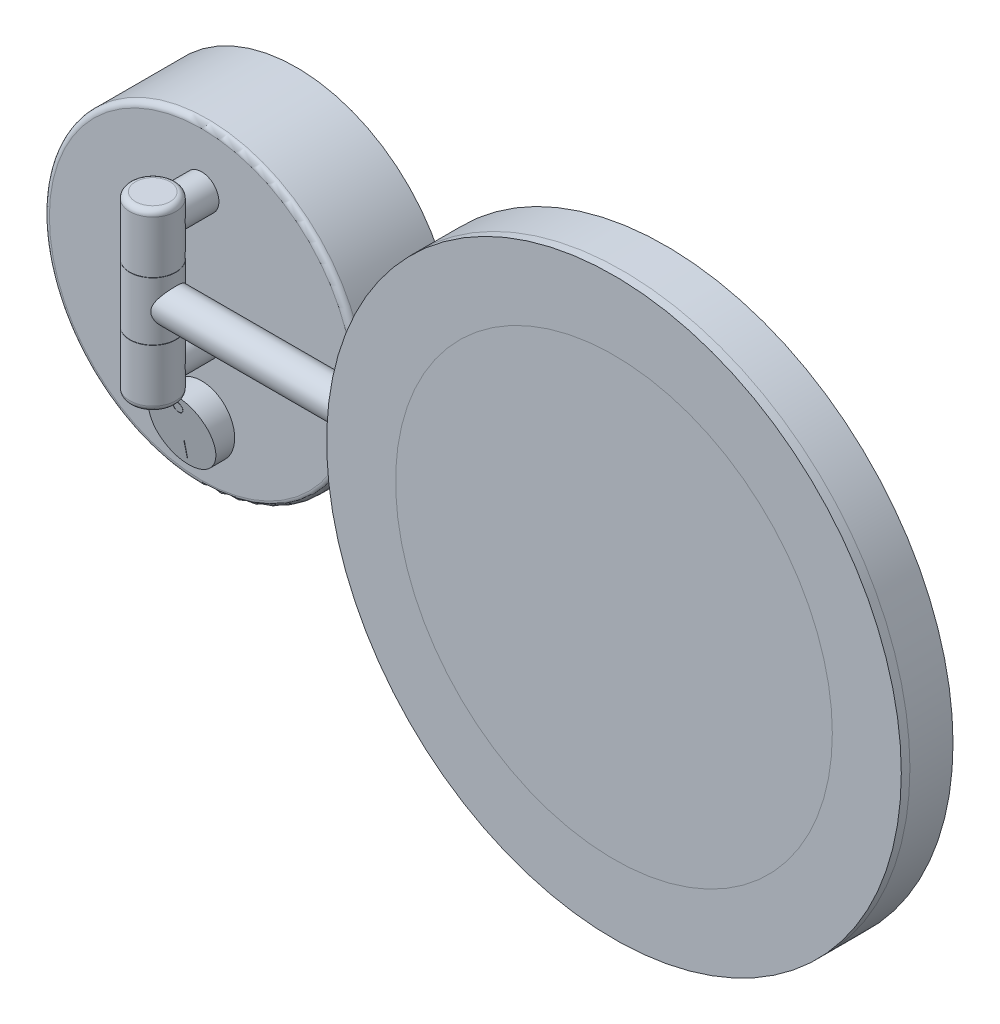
from build123d import *
from build123d.topology import SkipClean

# Parameters (mm, degrees)
CROQUIS1_R                 = 55
SALIENTE_EXTRUIR1_DEPTH    = 33
CROQUIS2_R                 = 6
SALIENTE_EXTRUIR2_DEPTH    = 9
BARRER1_PROFILE_R          = 8
SALIENTE_EXTRUIR3_REACH    = 90.397
CROQUIS17_R                = 6
SALIENTE_EXTRUIR4_DEPTH    = 9
CORTAR_EXTRUIR1_DEPTH      = 98.025769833
CORTAR_EXTRUIR1_DEPTH_BACK = 98.025769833
CROQUIS23_W                = 0.2
CROQUIS23_H                = 6
CORTAR_EXTRUIR2_DEPTH      = 0.1
CROQUIS24_R                = 1.785264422
CROQUIS24_R_2              = 1.685264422
CORTAR_EXTRUIR3_DEPTH      = 0.1
CROQUIS25_R                = 6
SALIENTE_EXTRUIR5_DEPTH    = 200
BARRER2_PROFILE_R          = 8
BARRER3_PROFILE_R          = 8
CROQUIS65_R                = 6.5
SALIENTE_EXTRUIR6_DEPTH    = 16
CROQUIS66_R                = 100
SALIENTE_EXTRUIR7_DEPTH    = 15
CROQUIS67_R                = 100
CROQUIS67_R_2              = 76
SALIENTE_EXTRUIR9_DEPTH    = 3
CROQUIS68_R                = 76
SALIENTE_EXTRUIR10_DEPTH   = 3
REDONDEO1_R                = 2
REDONDEO2_R                = 2
CROQUIS69_R                = 8.543506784
CROQUIS69_R_2              = 7.600875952
CORTAR_EXTRUIR4_DEPTH      = 0.1
CROQUIS70_R                = 8.543506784
CROQUIS70_R_2              = 7.600875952
CROQUIS70_R_3              = 9.674431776
CROQUIS70_R_4              = 7.055159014
CORTAR_EXTRUIR5_DEPTH      = 0.1
CROQUIS71_R                = 9.293521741
CROQUIS71_R_2              = 7.297415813
CORTAR_EXTRUIR6_DEPTH      = 0.1
CROQUIS72_R                = 9.21017824
CROQUIS72_R_2              = 7.558824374
CORTAR_EXTRUIR7_DEPTH      = 0.1
CROQUIS73_R                = 9.123708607
CROQUIS73_R_2              = 7.319281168
CORTAR_EXTRUIR8_DEPTH      = 0.1
CROQUIS74_R                = 9.729453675
CROQUIS74_R_2              = 7.072832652
CORTAR_EXTRUIR9_DEPTH      = 0.1
CROQUIS75_R                = 9.191988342
CROQUIS75_R_2              = 7.26205958
CORTAR_EXTRUIR10_DEPTH     = 0.1
CROQUIS76_R                = 5
CORTAR_EXTRUIR11_DEPTH     = 5
CROQUIS77_R                = 5
CORTAR_EXTRUIR12_DEPTH     = 5
CROQUIS78_R                = 5
CORTAR_EXTRUIR13_DEPTH     = 5
CROQUIS79_R                = 54
CORTAR_EXTRUIR14_DEPTH     = 20
REDONDEO3_R                = 2


with BuildPart() as part:
    # Croquis1 → Saliente-Extruir1 (new body)
    with BuildSketch(Plane.XY):
        Circle(CROQUIS1_R)
    extrude(amount=SALIENTE_EXTRUIR1_DEPTH)

    # Croquis2 → Saliente-Extruir2 (add)
    with BuildSketch(Plane.XY.offset(33)):
        with Locations((0, 34)):
            Circle(CROQUIS2_R)
        with Locations((0, -10)):
            Circle(CROQUIS2_R)
    extrude(amount=SALIENTE_EXTRUIR2_DEPTH)


with BuildPart() as body_2:
    # Barrer1: sweep along a path in Croquis4
    with BuildLine(Plane(origin=(0, 0, 0), x_dir=(0, 0, -1), z_dir=(1, 0, 0))) as barrer1_path:
        Line((-50, -18.5), (-50, 42.5))
    # Barrer1 profile (on start of the path) → Barrer1 (sweep)
    with BuildSketch(Plane(origin=(0, -18.5, 50), x_dir=(0, 0, 1), z_dir=(0, 1, 0))):
        Circle(BARRER1_PROFILE_R)
    sweep(path=barrer1_path.line)

    # Croquis17 → Saliente-Extruir3 (add, up to next)
    with BuildSketch(Plane.XY.offset(42), mode=Mode.PRIVATE) as saliente_extruir3_sk1:
        with Locations(Location((0, -10, 0), (0, 0, 180))):
            Circle(CROQUIS17_R)
    saliente_extruir3_tool1 = extrude(saliente_extruir3_sk1.sketch, amount=SALIENTE_EXTRUIR3_REACH, mode=Mode.PRIVATE) - body_2.part
    # Croquis17 → Saliente-Extruir3 (add, up to next)
    with BuildSketch(Plane.XY.offset(42), mode=Mode.PRIVATE) as saliente_extruir3_sk2:
        with Locations(Location((0, 34, 0), (0, 0, 180))):
            Circle(CROQUIS17_R)
    saliente_extruir3_tool2 = extrude(saliente_extruir3_sk2.sketch, amount=SALIENTE_EXTRUIR3_REACH, mode=Mode.PRIVATE) - body_2.part

    add(part.part)  # Saliente-Extruir3 merges part
    add(saliente_extruir3_tool1.solids().sort_by_distance((0, -10, 42))[0])
    add(saliente_extruir3_tool1.solids().sort_by_distance((0, -10, 42))[1])
    add(saliente_extruir3_tool2.solids().sort_by_distance((0, 34, 42))[0])
    add(saliente_extruir3_tool2.solids().sort_by_distance((0, 34, 42))[1])

    # Croquis18 → Saliente-Extruir4 (add)
    with SkipClean():  # the faces are left unmerged after this step: merging them gives an invalid solid
        with BuildSketch(Plane.XY.offset(33)):
            with BuildLine():
                ThreePointArc((0, -23), (-11.5, -34.5), (0, -46))
                Line((0, -46), (0, -23))
            make_face()
            with BuildLine():
                Line((0, -23), (0, -46))
                ThreePointArc((0, -46), (8.131727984, -42.631727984), (11.5, -34.5))
                ThreePointArc((11.5, -34.5), (8.131727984, -26.368272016), (0, -23))
            make_face()
            with BuildLine():
                ThreePointArc((0, -23), (-11.5, -34.5), (0, -46))
                Line((0, -46), (0, -23))
            make_face()
            with BuildLine():
                Line((0, -23), (0, -46))
                ThreePointArc((0, -46), (8.131727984, -42.631727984), (11.5, -34.5))
                ThreePointArc((11.5, -34.5), (8.131727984, -26.368272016), (0, -23))
            make_face()
        extrude(amount=SALIENTE_EXTRUIR4_DEPTH)

    # Croquis22 → Cortar-Extruir1 (cut, two sides: drawn at the far end of the back side and taken through both)
    with SkipClean():  # the faces are left unmerged after this step: merging them gives an invalid solid
        with BuildSketch(Plane(origin=(0, 0, 0), x_dir=(0, 0, -1), z_dir=(1, 0, 0)).offset(-CORTAR_EXTRUIR1_DEPTH_BACK)):
            Polygon((-42, -23), (-37.5, -46), (-44.397214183, -49.210702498), (-53.844887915, -46), align=None)
        extrude(amount=CORTAR_EXTRUIR1_DEPTH + CORTAR_EXTRUIR1_DEPTH_BACK, mode=Mode.SUBTRACT)

    # Croquis23 → Cortar-Extruir2 (cut)
    with SkipClean():  # the faces are left unmerged after this step: merging them gives an invalid solid
        with BuildSketch(Plane(origin=(0, -8.762403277, 44.78561675), x_dir=(1, 0, 0), z_dir=(0, -0.19201160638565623, 0.9813926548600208))):
            with Locations((0, -32.722704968)):
                Rectangle(CROQUIS23_W, CROQUIS23_H)
        extrude(amount=-CORTAR_EXTRUIR2_DEPTH, mode=Mode.SUBTRACT)

    # Croquis24 → Cortar-Extruir3 (cut)
    with SkipClean():  # the faces are left unmerged after this step: merging them gives an invalid solid
        with BuildSketch(Plane(origin=(0, -8.762403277, 44.78561675), x_dir=(1, 0, 0), z_dir=(0, -0.19201160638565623, 0.9813926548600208))):
            with Locations(Location((0, -18.312524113, 0), (0, 0, 270))):
                Circle(CROQUIS24_R)
            with Locations(Location((0, -18.312524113, 0), (0, 0, 270))):
                Circle(CROQUIS24_R_2, mode=Mode.SUBTRACT)
        extrude(amount=-CORTAR_EXTRUIR3_DEPTH, mode=Mode.SUBTRACT)

    # Croquis25 → Saliente-Extruir5 (add)
    with SkipClean():  # the faces are left unmerged after this step: merging them gives an invalid solid
        with BuildSketch(Plane(origin=(0, 0, 0), x_dir=(0, 0, -1), z_dir=(1, 0, 0))):
            with Locations(Location((-50, 12, 0), (0, 0, 180))):
                Circle(CROQUIS25_R)
        extrude(amount=SALIENTE_EXTRUIR5_DEPTH)

    # Barrer2: sweep along a path in Croquis26
    with SkipClean():  # the faces are left unmerged after this step: merging them gives an invalid solid
        with BuildLine(Plane(origin=(200, 0, 0), x_dir=(0, 0, -1), z_dir=(1, 0, 0))) as barrer2_path:
            Line((-50, -0.5), (-50, 49.5))
        # Barrer2 profile (on start of the path) → Barrer2 (sweep)
        with BuildSketch(Plane(origin=(200, -0.5, 50), x_dir=(0, 0, 1), z_dir=(0, 1, 0))):
            Circle(BARRER2_PROFILE_R)
        sweep(path=barrer2_path.line)

    # Barrer3: sweep along a path in Croquis40
    with SkipClean():  # the faces are left unmerged after this step: merging them gives an invalid solid
        with BuildLine(Plane.XY.offset(55.5)) as barrer3_path:
            Line((231, 37), (169, 37))
        # Barrer3 profile (on start of the path) → Barrer3 (sweep)
        with BuildSketch(Plane(origin=(231, 37, 55.5), x_dir=(0, 0, -1), z_dir=(-1, 0, 0))):
            Circle(BARRER3_PROFILE_R)
        sweep(path=barrer3_path.line)

    # Croquis65 → Saliente-Extruir6 (add)
    with SkipClean():  # the faces are left unmerged after this step: merging them gives an invalid solid
        with BuildSketch(Plane.XY.offset(55.5)):
            with Locations((220.666666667, 37)):
                Circle(CROQUIS65_R)
            with Locations(Location((179.333333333, 37, 0), (0, 0, 180))):
                Circle(CROQUIS65_R)
        extrude(amount=SALIENTE_EXTRUIR6_DEPTH)

    # Croquis66 → Saliente-Extruir7 (add)
    with BuildSketch(Plane.XY.offset(71.5)):
        with Locations((200, 37)):
            Circle(CROQUIS66_R)
    extrude(amount=SALIENTE_EXTRUIR7_DEPTH)

    # Redondeo1
    redondeo1_edges = [body_2.edges().sort_by_distance(p)[0] for p in [
        (200, 49.5, 42),
    ]]
    fillet(redondeo1_edges, radius=REDONDEO1_R)

    # Redondeo2
    redondeo2_edges = [body_2.edges().sort_by_distance(p)[0] for p in [
        (0, -18.5, 42),
        (0, 42.5, 42),
        (200, -0.5, 42),
        (169, 37, 63.5),
        (231, 37, 63.5),
    ]]
    fillet(redondeo2_edges, radius=REDONDEO2_R)

    # Croquis69 → Cortar-Extruir4 (cut)
    with BuildSketch(Plane(origin=(0, 1.83333333, 0), x_dir=(-1, 0, 0), z_dir=(0, -1, 0))):
        with Locations((0, -50)):
            Circle(CROQUIS69_R)
        with Locations(Location((0, -50, 0), (0, 0, 90))):
            Circle(CROQUIS69_R_2, mode=Mode.SUBTRACT)
    extrude(amount=-CORTAR_EXTRUIR4_DEPTH, mode=Mode.SUBTRACT)

    # Croquis70 → Cortar-Extruir5 (cut)
    # profile 1 of 2: a face of its own
    with BuildSketch(Plane(origin=(0, 1.83333333, 0), x_dir=(-1, 0, 0), z_dir=(0, -1, 0))):
        Circle(CROQUIS70_R)
        Circle(CROQUIS70_R_2, mode=Mode.SUBTRACT)
    # profile 2 of 2: a face of its own
    with BuildSketch(Plane(origin=(0, 1.83333333, 0), x_dir=(-1, 0, 0), z_dir=(0, -1, 0))):
        with Locations((0, -50)):
            Circle(CROQUIS70_R_3)
        with Locations(Location((0, -50, 0), (0, 0, 90))):
            Circle(CROQUIS70_R_4, mode=Mode.SUBTRACT)
    extrude(amount=-CORTAR_EXTRUIR5_DEPTH, mode=Mode.SUBTRACT)

    # Croquis71 → Cortar-Extruir6 (cut)
    with BuildSketch(Plane(origin=(0, 22.16666666, 0), x_dir=(-1, 0, 0), z_dir=(0, -1, 0))):
        with Locations((0, -50)):
            Circle(CROQUIS71_R)
        with Locations(Location((0, -50, 0), (0, 0, 90))):
            Circle(CROQUIS71_R_2, mode=Mode.SUBTRACT)
    extrude(amount=-CORTAR_EXTRUIR6_DEPTH, mode=Mode.SUBTRACT)

    # Croquis72 → Cortar-Extruir7 (cut)
    with BuildSketch(Plane(origin=(0, 24.5, 0), x_dir=(-1, 0, 0), z_dir=(0, -1, 0))):
        with Locations((-200, -50)):
            Circle(CROQUIS72_R)
        with Locations(Location((-200, -50, 0), (0, 0, 90))):
            Circle(CROQUIS72_R_2, mode=Mode.SUBTRACT)
    extrude(amount=-CORTAR_EXTRUIR7_DEPTH, mode=Mode.SUBTRACT)

    # Croquis73 → Cortar-Extruir8 (cut)
    with BuildSketch(Plane.ZY.offset(-189.33333333)):
        with Locations((55.5, 37)):
            Circle(CROQUIS73_R)
        with Locations((55.5, 37)):
            Circle(CROQUIS73_R_2, mode=Mode.SUBTRACT)
    extrude(amount=-CORTAR_EXTRUIR8_DEPTH, mode=Mode.SUBTRACT)

    # Croquis74 → Cortar-Extruir9 (cut)
    with BuildSketch(Plane.ZY.offset(-189.33333333)):
        with Locations((55.5, 37)):
            Circle(CROQUIS74_R)
        with Locations((55.5, 37)):
            Circle(CROQUIS74_R_2, mode=Mode.SUBTRACT)
    extrude(amount=-CORTAR_EXTRUIR9_DEPTH, mode=Mode.SUBTRACT)

    # Croquis75 → Cortar-Extruir10 (cut)
    with BuildSketch(Plane.ZY.offset(-209.66666666)):
        with Locations((55.5, 37)):
            Circle(CROQUIS75_R)
        with Locations((55.5, 37)):
            Circle(CROQUIS75_R_2, mode=Mode.SUBTRACT)
    extrude(amount=-CORTAR_EXTRUIR10_DEPTH, mode=Mode.SUBTRACT)

    # Croquis76 → Cortar-Extruir11 (cut)
    with BuildSketch(Plane.XZ.offset(18.5)):
        with Locations(Location((0, 50, 0), (0, 0, 270))):
            Circle(CROQUIS76_R)
    extrude(amount=-CORTAR_EXTRUIR11_DEPTH, mode=Mode.SUBTRACT)

    # Croquis77 → Cortar-Extruir12 (cut)
    with BuildSketch(Plane.XZ.offset(0.5)):
        with Locations(Location((200, 50, 0), (0, 0, 270))):
            Circle(CROQUIS77_R)
    extrude(amount=-CORTAR_EXTRUIR12_DEPTH, mode=Mode.SUBTRACT)

    # Croquis78 → Cortar-Extruir13 (cut)
    with BuildSketch(Plane(origin=(231, 0, 0), x_dir=(0, 0, -1), z_dir=(1, 0, 0))):
        with Locations((-55.5, 37)):
            Circle(CROQUIS78_R)
    extrude(amount=-CORTAR_EXTRUIR13_DEPTH, mode=Mode.SUBTRACT)

    # Croquis79 → Cortar-Extruir14 (cut)
    with BuildSketch(Plane(origin=(0, 0, 0), x_dir=(-1, 0, 0), z_dir=(0, 0, -1))):
        Circle(CROQUIS79_R)
    extrude(amount=-CORTAR_EXTRUIR14_DEPTH, mode=Mode.SUBTRACT)

    # Redondeo3
    redondeo3_edges = [body_2.edges().sort_by_distance(p)[0] for p in [
        (-55, 0, 33),
    ]]
    fillet(redondeo3_edges, radius=REDONDEO3_R)


with BuildPart() as body_2_2:
    # Croquis67 → Saliente-Extruir9 (new body)
    with BuildSketch(Plane.XY.offset(86.5)):
        with Locations((200, 37)):
            Circle(CROQUIS67_R)
        with Locations((200, 37)):
            Circle(CROQUIS67_R_2, mode=Mode.SUBTRACT)
    extrude(amount=SALIENTE_EXTRUIR9_DEPTH)


with BuildPart() as body_3:
    # Croquis68 → Saliente-Extruir10 (new body)
    with BuildSketch(Plane.XY.offset(86.5)):
        with Locations((200, 37)):
            Circle(CROQUIS68_R)
    extrude(amount=SALIENTE_EXTRUIR10_DEPTH)


solid = Compound([body_2.part, body_2_2.part, body_3.part])
